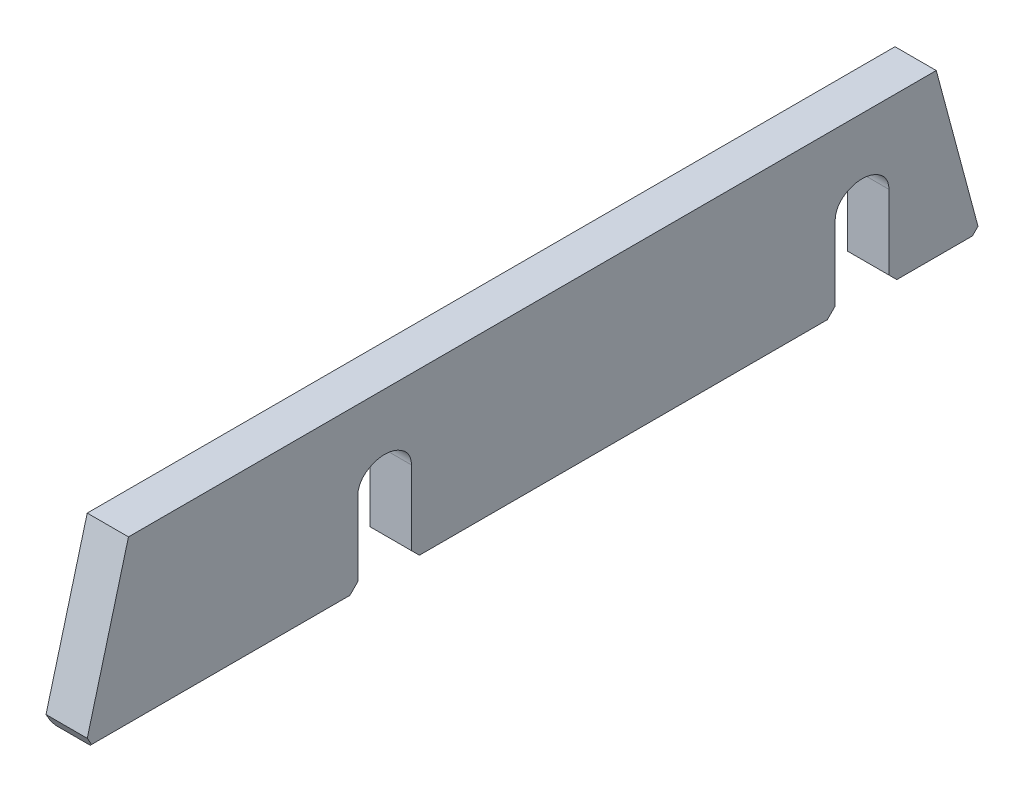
ISO-10303-21;
HEADER;
FILE_DESCRIPTION(('STEP AP214'),'2;1');
FILE_NAME('part.step','',(''),(''),'','','');
FILE_SCHEMA(('AUTOMOTIVE_DESIGN { 1 0 10303 214 1 1 1 1 }'));
ENDSEC;
DATA;
#1=APPLICATION_CONTEXT('core data for automotive mechanical design processes');
#2=APPLICATION_PROTOCOL_DEFINITION('international standard','automotive_design',2000,#1);
#3=PRODUCT_CONTEXT('',#1,'mechanical');
#4=PRODUCT('Part','Part','',(#3));
#5=PRODUCT_RELATED_PRODUCT_CATEGORY('part','',(#4));
#6=PRODUCT_DEFINITION_FORMATION('','',#4);
#7=PRODUCT_DEFINITION_CONTEXT('part definition',#1,'design');
#8=PRODUCT_DEFINITION('design','',#6,#7);
#9=PRODUCT_DEFINITION_SHAPE('','',#8);
#10=(LENGTH_UNIT() NAMED_UNIT(*) SI_UNIT(.MILLI.,.METRE.));
#11=(NAMED_UNIT(*) PLANE_ANGLE_UNIT() SI_UNIT($,.RADIAN.));
#12=(NAMED_UNIT(*) SI_UNIT($,.STERADIAN.) SOLID_ANGLE_UNIT());
#13=UNCERTAINTY_MEASURE_WITH_UNIT(LENGTH_MEASURE(1.E-05),#10,'distance_accuracy_value','');
#14=(GEOMETRIC_REPRESENTATION_CONTEXT(3) GLOBAL_UNCERTAINTY_ASSIGNED_CONTEXT((#13)) GLOBAL_UNIT_ASSIGNED_CONTEXT((#10,
#11,#12)) REPRESENTATION_CONTEXT('',''));
#15=CARTESIAN_POINT('',(0.,0.,0.));
#16=DIRECTION('',(0.,0.,1.));
#17=DIRECTION('',(1.,0.,0.));
#18=AXIS2_PLACEMENT_3D('',#15,#16,#17);
#19=CARTESIAN_POINT('',(101.6,-405.4975,1989.725));
#20=DIRECTION('',(0.,1.,0.));
#21=DIRECTION('',(0.,0.,1.));
#22=AXIS2_PLACEMENT_3D('',#19,#20,#21);
#23=PLANE('',#22);
#24=DIRECTION('',(0.,0.,-1.));
#25=VECTOR('',#24,1.);
#26=CARTESIAN_POINT('',(-85.6,-405.4975,1989.725));
#27=LINE('',#26,#25);
#28=CARTESIAN_POINT('',(-85.6,-405.4975,540.537499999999));
#29=VERTEX_POINT('',#28);
#30=CARTESIAN_POINT('',(-85.6,-405.4975,-1436.8985));
#31=VERTEX_POINT('',#30);
#32=EDGE_CURVE('E309',#29,#31,#27,.T.);
#33=ORIENTED_EDGE('',*,*,#32,.T.);
#34=DIRECTION('',(1.,0.,0.));
#35=VECTOR('',#34,1.);
#36=CARTESIAN_POINT('',(101.6,-405.4975,-1436.8985));
#37=LINE('',#36,#35);
#38=CARTESIAN_POINT('',(85.6,-405.4975,-1436.8985));
#39=VERTEX_POINT('',#38);
#40=EDGE_CURVE('E398',#31,#39,#37,.T.);
#41=ORIENTED_EDGE('',*,*,#40,.T.);
#42=DIRECTION('',(0.,0.,1.));
#43=VECTOR('',#42,1.);
#44=CARTESIAN_POINT('',(85.6,-405.4975,595.5375));
#45=LINE('',#44,#43);
#46=CARTESIAN_POINT('',(85.6,-405.4975,540.537499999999));
#47=VERTEX_POINT('',#46);
#48=EDGE_CURVE('E313',#39,#47,#45,.T.);
#49=ORIENTED_EDGE('',*,*,#48,.T.);
#50=DIRECTION('',(-1.,0.,0.));
#51=VECTOR('',#50,1.);
#52=CARTESIAN_POINT('',(101.6,-405.4975,540.537499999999));
#53=LINE('',#52,#51);
#54=EDGE_CURVE('E400',#47,#29,#53,.T.);
#55=ORIENTED_EDGE('',*,*,#54,.T.);
#56=EDGE_LOOP('',(#33,#41,#49,#55));
#57=FACE_BOUND('',#56,.T.);
#58=ADVANCED_FACE('F69',(#57),#23,.F.);
#59=DIRECTION('',(0.,0.,-1.));
#60=VECTOR('',#59,1.);
#61=CARTESIAN_POINT('',(-85.5999999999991,-405.4975,1989.725));
#62=LINE('',#61,#60);
#63=CARTESIAN_POINT('',(-85.5999999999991,-405.4975,-1811.4625));
#64=VERTEX_POINT('',#63);
#65=CARTESIAN_POINT('',(-85.5999999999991,-405.4975,-2152.03045531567));
#66=VERTEX_POINT('',#65);
#67=EDGE_CURVE('E305',#64,#66,#62,.T.);
#68=ORIENTED_EDGE('',*,*,#67,.T.);
#69=DIRECTION('',(1.,0.,0.));
#70=VECTOR('',#69,1.);
#71=CARTESIAN_POINT('',(101.6,-405.4975,-2152.03045531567));
#72=LINE('',#71,#70);
#73=CARTESIAN_POINT('',(85.5999999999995,-405.4975,-2152.03045531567));
#74=VERTEX_POINT('',#73);
#75=EDGE_CURVE('E366',#66,#74,#72,.T.);
#76=ORIENTED_EDGE('',*,*,#75,.T.);
#77=DIRECTION('',(0.,0.,1.));
#78=VECTOR('',#77,1.);
#79=CARTESIAN_POINT('',(85.5999999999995,-405.4975,-1756.4625));
#80=LINE('',#79,#78);
#81=CARTESIAN_POINT('',(85.5999999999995,-405.4975,-1811.4625));
#82=VERTEX_POINT('',#81);
#83=EDGE_CURVE('E306',#74,#82,#80,.T.);
#84=ORIENTED_EDGE('',*,*,#83,.T.);
#85=DIRECTION('',(-1.,0.,0.));
#86=VECTOR('',#85,1.);
#87=CARTESIAN_POINT('',(101.6,-405.4975,-1811.4625));
#88=LINE('',#87,#86);
#89=EDGE_CURVE('E361',#82,#64,#88,.T.);
#90=ORIENTED_EDGE('',*,*,#89,.T.);
#91=EDGE_LOOP('',(#68,#76,#84,#90));
#92=FACE_BOUND('',#91,.T.);
#93=ADVANCED_FACE('F598',(#92),#23,.F.);
#94=CARTESIAN_POINT('',(101.6,405.4975,1989.725));
#95=DIRECTION('',(0.,-1.,0.));
#96=DIRECTION('',(0.,0.,-1.));
#97=AXIS2_PLACEMENT_3D('',#94,#95,#96);
#98=PLANE('',#97);
#99=DIRECTION('',(0.,0.,1.));
#100=VECTOR('',#99,1.);
#101=CARTESIAN_POINT('',(-101.6,405.4975,1989.725));
#102=LINE('',#101,#100);
#103=CARTESIAN_POINT('',(-101.6,405.4975,-1989.725));
#104=VERTEX_POINT('',#103);
#105=CARTESIAN_POINT('',(-101.6,405.4975,1989.725));
#106=VERTEX_POINT('',#105);
#107=EDGE_CURVE('E260',#104,#106,#102,.T.);
#108=ORIENTED_EDGE('',*,*,#107,.T.);
#109=DIRECTION('',(-1.,0.,0.));
#110=VECTOR('',#109,1.);
#111=CARTESIAN_POINT('',(101.6,405.4975,1989.725));
#112=LINE('',#111,#110);
#113=CARTESIAN_POINT('',(101.6,405.4975,1989.725));
#114=VERTEX_POINT('',#113);
#115=EDGE_CURVE('E265',#114,#106,#112,.T.);
#116=ORIENTED_EDGE('',*,*,#115,.F.);
#117=DIRECTION('',(0.,0.,1.));
#118=VECTOR('',#117,1.);
#119=CARTESIAN_POINT('',(101.6,405.4975,1989.725));
#120=LINE('',#119,#118);
#121=CARTESIAN_POINT('',(101.6,405.4975,-1989.725));
#122=VERTEX_POINT('',#121);
#123=EDGE_CURVE('E266',#122,#114,#120,.T.);
#124=ORIENTED_EDGE('',*,*,#123,.F.);
#125=DIRECTION('',(-1.,0.,0.));
#126=VECTOR('',#125,1.);
#127=CARTESIAN_POINT('',(101.6,405.4975,-1989.725));
#128=LINE('',#127,#126);
#129=EDGE_CURVE('E263',#122,#104,#128,.T.);
#130=ORIENTED_EDGE('',*,*,#129,.T.);
#131=EDGE_LOOP('',(#108,#116,#124,#130));
#132=FACE_BOUND('',#131,.T.);
#133=ADVANCED_FACE('F258',(#132),#98,.F.);
#134=DIRECTION('',(0.,0.,-1.));
#135=VECTOR('',#134,1.);
#136=CARTESIAN_POINT('',(-85.6,-405.4975,1989.725));
#137=LINE('',#136,#135);
#138=CARTESIAN_POINT('',(-85.6,-405.4975,2162.12314336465));
#139=VERTEX_POINT('',#138);
#140=CARTESIAN_POINT('',(-85.6,-405.4975,915.101500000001));
#141=VERTEX_POINT('',#140);
#142=EDGE_CURVE('E319',#139,#141,#137,.T.);
#143=ORIENTED_EDGE('',*,*,#142,.T.);
#144=DIRECTION('',(1.,0.,0.));
#145=VECTOR('',#144,1.);
#146=CARTESIAN_POINT('',(101.6,-405.4975,915.101500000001));
#147=LINE('',#146,#145);
#148=CARTESIAN_POINT('',(85.5999999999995,-405.4975,915.101500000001));
#149=VERTEX_POINT('',#148);
#150=EDGE_CURVE('E428',#141,#149,#147,.T.);
#151=ORIENTED_EDGE('',*,*,#150,.T.);
#152=DIRECTION('',(0.,0.,1.));
#153=VECTOR('',#152,1.);
#154=CARTESIAN_POINT('',(85.5999999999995,-405.4975,2207.03045531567));
#155=LINE('',#154,#153);
#156=CARTESIAN_POINT('',(85.5999999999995,-405.4975,2162.12314336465));
#157=VERTEX_POINT('',#156);
#158=EDGE_CURVE('E321',#149,#157,#155,.T.);
#159=ORIENTED_EDGE('',*,*,#158,.T.);
#160=DIRECTION('',(-1.,0.,0.));
#161=VECTOR('',#160,1.);
#162=CARTESIAN_POINT('',(101.6,-405.4975,2162.12314336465));
#163=LINE('',#162,#161);
#164=EDGE_CURVE('E421',#157,#139,#163,.T.);
#165=ORIENTED_EDGE('',*,*,#164,.T.);
#166=EDGE_LOOP('',(#143,#151,#159,#165));
#167=FACE_BOUND('',#166,.T.);
#168=ADVANCED_FACE('F602',(#167),#23,.F.);
#169=CARTESIAN_POINT('',(101.6,0.,0.));
#170=DIRECTION('',(1.,0.,0.));
#171=DIRECTION('',(0.,0.,-1.));
#172=AXIS2_PLACEMENT_3D('',#169,#170,#171);
#173=PLANE('',#172);
#174=DIRECTION('',(0.,0.,-1.));
#175=VECTOR('',#174,1.);
#176=CARTESIAN_POINT('',(101.6,-389.497499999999,-2207.03045531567));
#177=LINE('',#176,#175);
#178=CARTESIAN_POINT('',(101.6,-389.497499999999,-1795.4625));
#179=VERTEX_POINT('',#178);
#180=CARTESIAN_POINT('',(101.6,-389.497499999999,-2168.03045531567));
#181=VERTEX_POINT('',#180);
#182=EDGE_CURVE('E296',#179,#181,#177,.T.);
#183=ORIENTED_EDGE('',*,*,#182,.T.);
#184=DIRECTION('',(0.,-0.707106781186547,0.707106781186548));
#185=VECTOR('',#184,1.);
#186=CARTESIAN_POINT('',(101.6,-1278.76397765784,-1278.76397765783));
#187=LINE('',#186,#185);
#188=CARTESIAN_POINT('',(101.6,-362.120367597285,-2195.40758771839));
#189=VERTEX_POINT('',#188);
#190=EDGE_CURVE('E389',#181,#189,#187,.F.);
#191=ORIENTED_EDGE('',*,*,#190,.T.);
#192=DIRECTION('',(0.,0.96592582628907,0.258819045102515));
#193=VECTOR('',#192,1.);
#194=CARTESIAN_POINT('',(101.6,405.4975,-1989.725));
#195=LINE('',#194,#193);
#196=EDGE_CURVE('E459',#189,#122,#195,.T.);
#197=ORIENTED_EDGE('',*,*,#196,.T.);
#198=ORIENTED_EDGE('',*,*,#123,.T.);
#199=DIRECTION('',(0.,-0.96592582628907,0.258819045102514));
#200=VECTOR('',#199,1.);
#201=CARTESIAN_POINT('',(101.6,405.4975,1989.725));
#202=LINE('',#201,#200);
#203=CARTESIAN_POINT('',(101.6,-352.371579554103,2192.79540783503));
#204=VERTEX_POINT('',#203);
#205=EDGE_CURVE('E279',#114,#204,#202,.T.);
#206=ORIENTED_EDGE('',*,*,#205,.T.);
#207=DIRECTION('',(0.,0.866025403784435,0.500000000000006));
#208=VECTOR('',#207,1.);
#209=CARTESIAN_POINT('',(101.6,-1037.60115913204,1797.17792560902));
#210=LINE('',#209,#208);
#211=CARTESIAN_POINT('',(101.6,-389.4975,2171.36074767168));
#212=VERTEX_POINT('',#211);
#213=EDGE_CURVE('E374',#204,#212,#210,.F.);
#214=ORIENTED_EDGE('',*,*,#213,.T.);
#215=DIRECTION('',(0.,0.,-1.));
#216=VECTOR('',#215,1.);
#217=CARTESIAN_POINT('',(101.6,-389.4975,860.1015));
#218=LINE('',#217,#216);
#219=CARTESIAN_POINT('',(101.6,-389.4975,899.101500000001));
#220=VERTEX_POINT('',#219);
#221=EDGE_CURVE('E287',#212,#220,#218,.T.);
#222=ORIENTED_EDGE('',*,*,#221,.T.);
#223=DIRECTION('',(0.,-0.707106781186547,0.707106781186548));
#224=VECTOR('',#223,1.);
#225=CARTESIAN_POINT('',(101.6,254.802,254.802));
#226=LINE('',#225,#224);
#227=CARTESIAN_POINT('',(101.6,-350.497499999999,860.1015));
#228=VERTEX_POINT('',#227);
#229=EDGE_CURVE('E377',#220,#228,#226,.F.);
#230=ORIENTED_EDGE('',*,*,#229,.T.);
#231=DIRECTION('',(0.,-1.,0.));
#232=VECTOR('',#231,1.);
#233=CARTESIAN_POINT('',(101.6,-405.4975,860.1015));
#234=LINE('',#233,#232);
#235=CARTESIAN_POINT('',(101.6,15.3246580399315,860.1015));
#236=VERTEX_POINT('',#235);
#237=EDGE_CURVE('E480',#236,#228,#234,.T.);
#238=ORIENTED_EDGE('',*,*,#237,.F.);
#239=CARTESIAN_POINT('',(101.6,15.3246580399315,760.1015));
#240=DIRECTION('',(1.,0.,0.));
#241=DIRECTION('',(0.,0.,1.));
#242=AXIS2_PLACEMENT_3D('',#239,#240,#241);
#243=CIRCLE('',#242,100.);
#244=CARTESIAN_POINT('',(101.6,93.8402975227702,822.03125340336));
#245=VERTEX_POINT('',#244);
#246=EDGE_CURVE('E472',#245,#236,#243,.T.);
#247=ORIENTED_EDGE('',*,*,#246,.F.);
#248=CARTESIAN_POINT('',(101.6,-25.6030339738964,727.8195));
#249=DIRECTION('',(1.,0.,0.));
#250=DIRECTION('',(0.,0.,1.));
#251=AXIS2_PLACEMENT_3D('',#248,#249,#250);
#252=CIRCLE('',#251,152.126802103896);
#253=CARTESIAN_POINT('',(101.6,93.84029752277,633.607746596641));
#254=VERTEX_POINT('',#253);
#255=EDGE_CURVE('E469',#254,#245,#252,.T.);
#256=ORIENTED_EDGE('',*,*,#255,.F.);
#257=CARTESIAN_POINT('',(101.6,15.3246580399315,695.5375));
#258=DIRECTION('',(1.,0.,0.));
#259=DIRECTION('',(0.,0.,-1.));
#260=AXIS2_PLACEMENT_3D('',#257,#258,#259);
#261=CIRCLE('',#260,100.);
#262=CARTESIAN_POINT('',(101.6,15.3246580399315,595.5375));
#263=VERTEX_POINT('',#262);
#264=EDGE_CURVE('E461',#263,#254,#261,.T.);
#265=ORIENTED_EDGE('',*,*,#264,.F.);
#266=DIRECTION('',(0.,1.,0.));
#267=VECTOR('',#266,1.);
#268=CARTESIAN_POINT('',(101.6,-405.4975,595.5375));
#269=LINE('',#268,#267);
#270=CARTESIAN_POINT('',(101.6,-350.497499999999,595.5375));
#271=VERTEX_POINT('',#270);
#272=EDGE_CURVE('E462',#271,#263,#269,.T.);
#273=ORIENTED_EDGE('',*,*,#272,.F.);
#274=DIRECTION('',(0.,0.707106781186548,0.707106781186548));
#275=VECTOR('',#274,1.);
#276=CARTESIAN_POINT('',(101.6,-473.0175,473.0175));
#277=LINE('',#276,#275);
#278=CARTESIAN_POINT('',(101.6,-389.4975,556.537499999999));
#279=VERTEX_POINT('',#278);
#280=EDGE_CURVE('E382',#271,#279,#277,.F.);
#281=ORIENTED_EDGE('',*,*,#280,.T.);
#282=DIRECTION('',(0.,0.,-1.));
#283=VECTOR('',#282,1.);
#284=CARTESIAN_POINT('',(101.6,-389.4975,-1491.8985));
#285=LINE('',#284,#283);
#286=CARTESIAN_POINT('',(101.6,-389.4975,-1452.8985));
#287=VERTEX_POINT('',#286);
#288=EDGE_CURVE('E293',#279,#287,#285,.T.);
#289=ORIENTED_EDGE('',*,*,#288,.T.);
#290=DIRECTION('',(0.,-0.707106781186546,0.707106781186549));
#291=VECTOR('',#290,1.);
#292=CARTESIAN_POINT('',(101.6,-921.198,-921.197999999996));
#293=LINE('',#292,#291);
#294=CARTESIAN_POINT('',(101.6,-350.497499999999,-1491.8985));
#295=VERTEX_POINT('',#294);
#296=EDGE_CURVE('E381',#287,#295,#293,.F.);
#297=ORIENTED_EDGE('',*,*,#296,.T.);
#298=DIRECTION('',(0.,-1.,0.));
#299=VECTOR('',#298,1.);
#300=CARTESIAN_POINT('',(101.6,15.3246580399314,-1491.8985));
#301=LINE('',#300,#299);
#302=CARTESIAN_POINT('',(101.6,15.3246580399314,-1491.8985));
#303=VERTEX_POINT('',#302);
#304=EDGE_CURVE('E538',#303,#295,#301,.T.);
#305=ORIENTED_EDGE('',*,*,#304,.F.);
#306=CARTESIAN_POINT('',(101.6,15.3246580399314,-1591.8985));
#307=DIRECTION('',(1.,0.,0.));
#308=DIRECTION('',(0.,0.,-1.));
#309=AXIS2_PLACEMENT_3D('',#306,#307,#308);
#310=CIRCLE('',#309,100.);
#311=CARTESIAN_POINT('',(101.6,93.8402975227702,-1529.96874659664));
#312=VERTEX_POINT('',#311);
#313=EDGE_CURVE('E544',#312,#303,#310,.T.);
#314=ORIENTED_EDGE('',*,*,#313,.F.);
#315=CARTESIAN_POINT('',(101.6,-25.6030339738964,-1624.1805));
#316=DIRECTION('',(1.,0.,0.));
#317=DIRECTION('',(0.,0.,1.));
#318=AXIS2_PLACEMENT_3D('',#315,#316,#317);
#319=CIRCLE('',#318,152.126802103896);
#320=CARTESIAN_POINT('',(101.6,93.8402975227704,-1718.39225340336));
#321=VERTEX_POINT('',#320);
#322=EDGE_CURVE('E550',#321,#312,#319,.T.);
#323=ORIENTED_EDGE('',*,*,#322,.F.);
#324=CARTESIAN_POINT('',(101.6,15.3246580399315,-1656.4625));
#325=DIRECTION('',(1.,0.,0.));
#326=DIRECTION('',(0.,0.,1.));
#327=AXIS2_PLACEMENT_3D('',#324,#325,#326);
#328=CIRCLE('',#327,100.);
#329=CARTESIAN_POINT('',(101.6,15.3246580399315,-1756.4625));
#330=VERTEX_POINT('',#329);
#331=EDGE_CURVE('E553',#330,#321,#328,.T.);
#332=ORIENTED_EDGE('',*,*,#331,.F.);
#333=DIRECTION('',(0.,1.,0.));
#334=VECTOR('',#333,1.);
#335=CARTESIAN_POINT('',(101.6,-405.4975,-1756.4625));
#336=LINE('',#335,#334);
#337=CARTESIAN_POINT('',(101.6,-350.497499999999,-1756.4625));
#338=VERTEX_POINT('',#337);
#339=EDGE_CURVE('E463',#338,#330,#336,.T.);
#340=ORIENTED_EDGE('',*,*,#339,.F.);
#341=DIRECTION('',(0.,0.707106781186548,0.707106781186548));
#342=VECTOR('',#341,1.);
#343=CARTESIAN_POINT('',(101.6,702.982500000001,-702.982500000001));
#344=LINE('',#343,#342);
#345=EDGE_CURVE('E390',#338,#179,#344,.F.);
#346=ORIENTED_EDGE('',*,*,#345,.T.);
#347=EDGE_LOOP('',(#183,#191,#197,#198,#206,#214,#222,#230,#238,#247,#256,#265,#273,#281,#289,
#297,#305,#314,#323,#332,#340,#346));
#348=FACE_BOUND('',#347,.T.);
#349=ADVANCED_FACE('F450',(#348),#173,.T.);
#350=CARTESIAN_POINT('',(-101.6,0.,0.));
#351=DIRECTION('',(1.,0.,0.));
#352=DIRECTION('',(0.,0.,-1.));
#353=AXIS2_PLACEMENT_3D('',#350,#351,#352);
#354=PLANE('',#353);
#355=DIRECTION('',(0.,0.96592582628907,0.258819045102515));
#356=VECTOR('',#355,1.);
#357=CARTESIAN_POINT('',(-101.6,405.4975,-1989.725));
#358=LINE('',#357,#356);
#359=CARTESIAN_POINT('',(-101.6,-362.120367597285,-2195.40758771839));
#360=VERTEX_POINT('',#359);
#361=EDGE_CURVE('E282',#360,#104,#358,.T.);
#362=ORIENTED_EDGE('',*,*,#361,.F.);
#363=DIRECTION('',(0.,0.707106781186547,-0.707106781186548));
#364=VECTOR('',#363,1.);
#365=CARTESIAN_POINT('',(-101.6,-362.120367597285,-2195.40758771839));
#366=LINE('',#365,#364);
#367=CARTESIAN_POINT('',(-101.6,-389.497499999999,-2168.03045531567));
#368=VERTEX_POINT('',#367);
#369=EDGE_CURVE('E351',#360,#368,#366,.F.);
#370=ORIENTED_EDGE('',*,*,#369,.T.);
#371=DIRECTION('',(0.,0.,1.));
#372=VECTOR('',#371,1.);
#373=CARTESIAN_POINT('',(-101.6,-389.4975,0.));
#374=LINE('',#373,#372);
#375=CARTESIAN_POINT('',(-101.6,-389.497499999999,-1795.4625));
#376=VERTEX_POINT('',#375);
#377=EDGE_CURVE('E335',#368,#376,#374,.T.);
#378=ORIENTED_EDGE('',*,*,#377,.T.);
#379=DIRECTION('',(0.,-0.707106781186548,-0.707106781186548));
#380=VECTOR('',#379,1.);
#381=CARTESIAN_POINT('',(-101.6,-350.497499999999,-1756.4625));
#382=LINE('',#381,#380);
#383=CARTESIAN_POINT('',(-101.6,-350.497499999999,-1756.4625));
#384=VERTEX_POINT('',#383);
#385=EDGE_CURVE('E352',#376,#384,#382,.F.);
#386=ORIENTED_EDGE('',*,*,#385,.T.);
#387=DIRECTION('',(0.,1.,0.));
#388=VECTOR('',#387,1.);
#389=CARTESIAN_POINT('',(-101.6,-405.4975,-1756.4625));
#390=LINE('',#389,#388);
#391=CARTESIAN_POINT('',(-101.6,15.3246580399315,-1756.4625));
#392=VERTEX_POINT('',#391);
#393=EDGE_CURVE('E536',#384,#392,#390,.T.);
#394=ORIENTED_EDGE('',*,*,#393,.T.);
#395=CARTESIAN_POINT('',(-101.6,15.3246580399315,-1656.4625));
#396=DIRECTION('',(1.,0.,0.));
#397=DIRECTION('',(0.,0.,1.));
#398=AXIS2_PLACEMENT_3D('',#395,#396,#397);
#399=CIRCLE('',#398,100.);
#400=CARTESIAN_POINT('',(-101.6,93.8402975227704,-1718.39225340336));
#401=VERTEX_POINT('',#400);
#402=EDGE_CURVE('E535',#392,#401,#399,.T.);
#403=ORIENTED_EDGE('',*,*,#402,.T.);
#404=CARTESIAN_POINT('',(-101.6,-25.6030339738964,-1624.1805));
#405=DIRECTION('',(1.,0.,0.));
#406=DIRECTION('',(0.,0.,1.));
#407=AXIS2_PLACEMENT_3D('',#404,#405,#406);
#408=CIRCLE('',#407,152.126802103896);
#409=CARTESIAN_POINT('',(-101.6,93.8402975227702,-1529.96874659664));
#410=VERTEX_POINT('',#409);
#411=EDGE_CURVE('E529',#401,#410,#408,.T.);
#412=ORIENTED_EDGE('',*,*,#411,.T.);
#413=CARTESIAN_POINT('',(-101.6,15.3246580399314,-1591.8985));
#414=DIRECTION('',(1.,0.,0.));
#415=DIRECTION('',(0.,0.,-1.));
#416=AXIS2_PLACEMENT_3D('',#413,#414,#415);
#417=CIRCLE('',#416,100.);
#418=CARTESIAN_POINT('',(-101.6,15.3246580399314,-1491.8985));
#419=VERTEX_POINT('',#418);
#420=EDGE_CURVE('E521',#410,#419,#417,.T.);
#421=ORIENTED_EDGE('',*,*,#420,.T.);
#422=DIRECTION('',(0.,-1.,0.));
#423=VECTOR('',#422,1.);
#424=CARTESIAN_POINT('',(-101.6,15.3246580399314,-1491.8985));
#425=LINE('',#424,#423);
#426=CARTESIAN_POINT('',(-101.6,-350.497499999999,-1491.8985));
#427=VERTEX_POINT('',#426);
#428=EDGE_CURVE('E513',#419,#427,#425,.T.);
#429=ORIENTED_EDGE('',*,*,#428,.T.);
#430=DIRECTION('',(0.,0.707106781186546,-0.707106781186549));
#431=VECTOR('',#430,1.);
#432=CARTESIAN_POINT('',(-101.6,-405.4975,-1436.8985));
#433=LINE('',#432,#431);
#434=CARTESIAN_POINT('',(-101.6,-389.4975,-1452.8985));
#435=VERTEX_POINT('',#434);
#436=EDGE_CURVE('E349',#427,#435,#433,.F.);
#437=ORIENTED_EDGE('',*,*,#436,.T.);
#438=DIRECTION('',(0.,0.,1.));
#439=VECTOR('',#438,1.);
#440=CARTESIAN_POINT('',(-101.6,-389.4975,0.));
#441=LINE('',#440,#439);
#442=CARTESIAN_POINT('',(-101.6,-389.4975,556.537499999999));
#443=VERTEX_POINT('',#442);
#444=EDGE_CURVE('E329',#435,#443,#441,.T.);
#445=ORIENTED_EDGE('',*,*,#444,.T.);
#446=DIRECTION('',(0.,-0.707106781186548,-0.707106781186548));
#447=VECTOR('',#446,1.);
#448=CARTESIAN_POINT('',(-101.6,-350.497499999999,595.5375));
#449=LINE('',#448,#447);
#450=CARTESIAN_POINT('',(-101.6,-350.497499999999,595.5375));
#451=VERTEX_POINT('',#450);
#452=EDGE_CURVE('E344',#443,#451,#449,.F.);
#453=ORIENTED_EDGE('',*,*,#452,.T.);
#454=DIRECTION('',(0.,1.,0.));
#455=VECTOR('',#454,1.);
#456=CARTESIAN_POINT('',(-101.6,-405.4975,595.5375));
#457=LINE('',#456,#455);
#458=CARTESIAN_POINT('',(-101.6,15.3246580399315,595.5375));
#459=VERTEX_POINT('',#458);
#460=EDGE_CURVE('E482',#451,#459,#457,.T.);
#461=ORIENTED_EDGE('',*,*,#460,.T.);
#462=CARTESIAN_POINT('',(-101.6,15.3246580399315,695.5375));
#463=DIRECTION('',(1.,0.,0.));
#464=DIRECTION('',(0.,0.,-1.));
#465=AXIS2_PLACEMENT_3D('',#462,#463,#464);
#466=CIRCLE('',#465,100.);
#467=CARTESIAN_POINT('',(-101.6,93.84029752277,633.607746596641));
#468=VERTEX_POINT('',#467);
#469=EDGE_CURVE('E481',#459,#468,#466,.T.);
#470=ORIENTED_EDGE('',*,*,#469,.T.);
#471=CARTESIAN_POINT('',(-101.6,-25.6030339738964,727.8195));
#472=DIRECTION('',(1.,0.,0.));
#473=DIRECTION('',(0.,0.,1.));
#474=AXIS2_PLACEMENT_3D('',#471,#472,#473);
#475=CIRCLE('',#474,152.126802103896);
#476=CARTESIAN_POINT('',(-101.6,93.8402975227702,822.03125340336));
#477=VERTEX_POINT('',#476);
#478=EDGE_CURVE('E486',#468,#477,#475,.T.);
#479=ORIENTED_EDGE('',*,*,#478,.T.);
#480=CARTESIAN_POINT('',(-101.6,15.3246580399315,760.1015));
#481=DIRECTION('',(1.,0.,0.));
#482=DIRECTION('',(0.,0.,1.));
#483=AXIS2_PLACEMENT_3D('',#480,#481,#482);
#484=CIRCLE('',#483,100.);
#485=CARTESIAN_POINT('',(-101.6,15.3246580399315,860.1015));
#486=VERTEX_POINT('',#485);
#487=EDGE_CURVE('E495',#477,#486,#484,.T.);
#488=ORIENTED_EDGE('',*,*,#487,.T.);
#489=DIRECTION('',(0.,-1.,0.));
#490=VECTOR('',#489,1.);
#491=CARTESIAN_POINT('',(-101.6,-405.4975,860.1015));
#492=LINE('',#491,#490);
#493=CARTESIAN_POINT('',(-101.6,-350.497499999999,860.1015));
#494=VERTEX_POINT('',#493);
#495=EDGE_CURVE('E496',#486,#494,#492,.T.);
#496=ORIENTED_EDGE('',*,*,#495,.T.);
#497=DIRECTION('',(0.,0.707106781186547,-0.707106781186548));
#498=VECTOR('',#497,1.);
#499=CARTESIAN_POINT('',(-101.6,-405.4975,915.101500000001));
#500=LINE('',#499,#498);
#501=CARTESIAN_POINT('',(-101.6,-389.4975,899.101500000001));
#502=VERTEX_POINT('',#501);
#503=EDGE_CURVE('E345',#494,#502,#500,.F.);
#504=ORIENTED_EDGE('',*,*,#503,.T.);
#505=DIRECTION('',(0.,0.,1.));
#506=VECTOR('',#505,1.);
#507=CARTESIAN_POINT('',(-101.6,-389.4975,0.));
#508=LINE('',#507,#506);
#509=CARTESIAN_POINT('',(-101.6,-389.4975,2171.36074767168));
#510=VERTEX_POINT('',#509);
#511=EDGE_CURVE('E324',#502,#510,#508,.T.);
#512=ORIENTED_EDGE('',*,*,#511,.T.);
#513=DIRECTION('',(0.,-0.866025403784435,-0.500000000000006));
#514=VECTOR('',#513,1.);
#515=CARTESIAN_POINT('',(-101.6,-405.4975,2162.12314336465));
#516=LINE('',#515,#514);
#517=CARTESIAN_POINT('',(-101.6,-352.371579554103,2192.79540783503));
#518=VERTEX_POINT('',#517);
#519=EDGE_CURVE('E276',#510,#518,#516,.F.);
#520=ORIENTED_EDGE('',*,*,#519,.T.);
#521=DIRECTION('',(0.,-0.96592582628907,0.258819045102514));
#522=VECTOR('',#521,1.);
#523=CARTESIAN_POINT('',(-101.6,405.4975,1989.725));
#524=LINE('',#523,#522);
#525=EDGE_CURVE('E271',#106,#518,#524,.T.);
#526=ORIENTED_EDGE('',*,*,#525,.F.);
#527=ORIENTED_EDGE('',*,*,#107,.F.);
#528=EDGE_LOOP('',(#362,#370,#378,#386,#394,#403,#412,#421,#429,#437,#445,#453,#461,#470,#479,
#488,#496,#504,#512,#520,#526,#527));
#529=FACE_BOUND('',#528,.T.);
#530=ADVANCED_FACE('F274',(#529),#354,.F.);
#531=CARTESIAN_POINT('',(-101.6,15.3246580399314,-1491.8985));
#532=DIRECTION('',(0.,0.,1.));
#533=DIRECTION('',(1.,0.,0.));
#534=AXIS2_PLACEMENT_3D('',#531,#532,#533);
#535=PLANE('',#534);
#536=ORIENTED_EDGE('',*,*,#304,.T.);
#537=DIRECTION('',(-1.,0.,0.));
#538=VECTOR('',#537,1.);
#539=CARTESIAN_POINT('',(-101.6,-350.497499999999,-1491.8985));
#540=LINE('',#539,#538);
#541=EDGE_CURVE('E409',#295,#427,#540,.T.);
#542=ORIENTED_EDGE('',*,*,#541,.T.);
#543=ORIENTED_EDGE('',*,*,#428,.F.);
#544=DIRECTION('',(1.,0.,0.));
#545=VECTOR('',#544,1.);
#546=CARTESIAN_POINT('',(-101.6,15.3246580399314,-1491.8985));
#547=LINE('',#546,#545);
#548=EDGE_CURVE('E448',#419,#303,#547,.T.);
#549=ORIENTED_EDGE('',*,*,#548,.T.);
#550=EDGE_LOOP('',(#536,#542,#543,#549));
#551=FACE_BOUND('',#550,.T.);
#552=ADVANCED_FACE('F668',(#551),#535,.F.);
#553=CARTESIAN_POINT('',(-101.6,15.3246580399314,-1591.8985));
#554=DIRECTION('',(1.,0.,0.));
#555=DIRECTION('',(0.,0.,-1.));
#556=AXIS2_PLACEMENT_3D('',#553,#554,#555);
#557=CYLINDRICAL_SURFACE('',#556,100.);
#558=ORIENTED_EDGE('',*,*,#548,.F.);
#559=ORIENTED_EDGE('',*,*,#420,.F.);
#560=DIRECTION('',(1.,0.,0.));
#561=VECTOR('',#560,1.);
#562=CARTESIAN_POINT('',(-101.6,93.8402975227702,-1529.96874659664));
#563=LINE('',#562,#561);
#564=EDGE_CURVE('E452',#410,#312,#563,.T.);
#565=ORIENTED_EDGE('',*,*,#564,.T.);
#566=ORIENTED_EDGE('',*,*,#313,.T.);
#567=EDGE_LOOP('',(#558,#559,#565,#566));
#568=FACE_BOUND('',#567,.T.);
#569=ADVANCED_FACE('F675',(#568),#557,.F.);
#570=CARTESIAN_POINT('',(-101.6,-25.6030339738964,-1624.1805));
#571=DIRECTION('',(1.,0.,0.));
#572=DIRECTION('',(0.,0.,-1.));
#573=AXIS2_PLACEMENT_3D('',#570,#571,#572);
#574=CYLINDRICAL_SURFACE('',#573,152.126802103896);
#575=ORIENTED_EDGE('',*,*,#564,.F.);
#576=ORIENTED_EDGE('',*,*,#411,.F.);
#577=DIRECTION('',(1.,0.,0.));
#578=VECTOR('',#577,1.);
#579=CARTESIAN_POINT('',(-101.6,93.8402975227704,-1718.39225340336));
#580=LINE('',#579,#578);
#581=EDGE_CURVE('E516',#401,#321,#580,.T.);
#582=ORIENTED_EDGE('',*,*,#581,.T.);
#583=ORIENTED_EDGE('',*,*,#322,.T.);
#584=EDGE_LOOP('',(#575,#576,#582,#583));
#585=FACE_BOUND('',#584,.T.);
#586=ADVANCED_FACE('F575',(#585),#574,.F.);
#587=CARTESIAN_POINT('',(-101.6,15.3246580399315,-1656.4625));
#588=DIRECTION('',(1.,0.,0.));
#589=DIRECTION('',(0.,0.,-1.));
#590=AXIS2_PLACEMENT_3D('',#587,#588,#589);
#591=CYLINDRICAL_SURFACE('',#590,100.);
#592=ORIENTED_EDGE('',*,*,#581,.F.);
#593=ORIENTED_EDGE('',*,*,#402,.F.);
#594=DIRECTION('',(1.,0.,0.));
#595=VECTOR('',#594,1.);
#596=CARTESIAN_POINT('',(-101.6,15.3246580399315,-1756.4625));
#597=LINE('',#596,#595);
#598=EDGE_CURVE('E512',#392,#330,#597,.T.);
#599=ORIENTED_EDGE('',*,*,#598,.T.);
#600=ORIENTED_EDGE('',*,*,#331,.T.);
#601=EDGE_LOOP('',(#592,#593,#599,#600));
#602=FACE_BOUND('',#601,.T.);
#603=ADVANCED_FACE('F570',(#602),#591,.F.);
#604=CARTESIAN_POINT('',(-101.6,-405.4975,-1756.4625));
#605=DIRECTION('',(0.,0.,-1.));
#606=DIRECTION('',(-1.,0.,0.));
#607=AXIS2_PLACEMENT_3D('',#604,#605,#606);
#608=PLANE('',#607);
#609=ORIENTED_EDGE('',*,*,#393,.F.);
#610=DIRECTION('',(1.,0.,0.));
#611=VECTOR('',#610,1.);
#612=CARTESIAN_POINT('',(-101.6,-350.497499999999,-1756.4625));
#613=LINE('',#612,#611);
#614=EDGE_CURVE('E394',#384,#338,#613,.T.);
#615=ORIENTED_EDGE('',*,*,#614,.T.);
#616=ORIENTED_EDGE('',*,*,#339,.T.);
#617=ORIENTED_EDGE('',*,*,#598,.F.);
#618=EDGE_LOOP('',(#609,#615,#616,#617));
#619=FACE_BOUND('',#618,.T.);
#620=ADVANCED_FACE('F565',(#619),#608,.F.);
#621=CARTESIAN_POINT('',(-101.6,-405.4975,860.1015));
#622=DIRECTION('',(0.,0.,1.));
#623=DIRECTION('',(0.,-1.,0.));
#624=AXIS2_PLACEMENT_3D('',#621,#622,#623);
#625=PLANE('',#624);
#626=ORIENTED_EDGE('',*,*,#237,.T.);
#627=DIRECTION('',(-1.,0.,0.));
#628=VECTOR('',#627,1.);
#629=CARTESIAN_POINT('',(-101.6,-350.497499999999,860.1015));
#630=LINE('',#629,#628);
#631=EDGE_CURVE('E436',#228,#494,#630,.T.);
#632=ORIENTED_EDGE('',*,*,#631,.T.);
#633=ORIENTED_EDGE('',*,*,#495,.F.);
#634=DIRECTION('',(1.,0.,0.));
#635=VECTOR('',#634,1.);
#636=CARTESIAN_POINT('',(-101.6,15.3246580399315,860.1015));
#637=LINE('',#636,#635);
#638=EDGE_CURVE('E268',#486,#236,#637,.T.);
#639=ORIENTED_EDGE('',*,*,#638,.T.);
#640=EDGE_LOOP('',(#626,#632,#633,#639));
#641=FACE_BOUND('',#640,.T.);
#642=ADVANCED_FACE('F628',(#641),#625,.F.);
#643=CARTESIAN_POINT('',(-101.6,15.3246580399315,760.1015));
#644=DIRECTION('',(1.,0.,0.));
#645=DIRECTION('',(0.,0.,-1.));
#646=AXIS2_PLACEMENT_3D('',#643,#644,#645);
#647=CYLINDRICAL_SURFACE('',#646,100.);
#648=ORIENTED_EDGE('',*,*,#638,.F.);
#649=ORIENTED_EDGE('',*,*,#487,.F.);
#650=DIRECTION('',(1.,0.,0.));
#651=VECTOR('',#650,1.);
#652=CARTESIAN_POINT('',(-101.6,93.8402975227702,822.03125340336));
#653=LINE('',#652,#651);
#654=EDGE_CURVE('E505',#477,#245,#653,.T.);
#655=ORIENTED_EDGE('',*,*,#654,.T.);
#656=ORIENTED_EDGE('',*,*,#246,.T.);
#657=EDGE_LOOP('',(#648,#649,#655,#656));
#658=FACE_BOUND('',#657,.T.);
#659=ADVANCED_FACE('F635',(#658),#647,.F.);
#660=CARTESIAN_POINT('',(-101.6,-25.6030339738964,727.8195));
#661=DIRECTION('',(1.,0.,0.));
#662=DIRECTION('',(0.,0.,-1.));
#663=AXIS2_PLACEMENT_3D('',#660,#661,#662);
#664=CYLINDRICAL_SURFACE('',#663,152.126802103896);
#665=ORIENTED_EDGE('',*,*,#654,.F.);
#666=ORIENTED_EDGE('',*,*,#478,.F.);
#667=DIRECTION('',(1.,0.,0.));
#668=VECTOR('',#667,1.);
#669=CARTESIAN_POINT('',(-101.6,93.84029752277,633.607746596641));
#670=LINE('',#669,#668);
#671=EDGE_CURVE('E504',#468,#254,#670,.T.);
#672=ORIENTED_EDGE('',*,*,#671,.T.);
#673=ORIENTED_EDGE('',*,*,#255,.T.);
#674=EDGE_LOOP('',(#665,#666,#672,#673));
#675=FACE_BOUND('',#674,.T.);
#676=ADVANCED_FACE('F640',(#675),#664,.F.);
#677=CARTESIAN_POINT('',(-101.6,15.3246580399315,695.5375));
#678=DIRECTION('',(1.,0.,0.));
#679=DIRECTION('',(0.,0.,-1.));
#680=AXIS2_PLACEMENT_3D('',#677,#678,#679);
#681=CYLINDRICAL_SURFACE('',#680,100.);
#682=ORIENTED_EDGE('',*,*,#671,.F.);
#683=ORIENTED_EDGE('',*,*,#469,.F.);
#684=DIRECTION('',(1.,0.,0.));
#685=VECTOR('',#684,1.);
#686=CARTESIAN_POINT('',(-101.6,15.3246580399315,595.5375));
#687=LINE('',#686,#685);
#688=EDGE_CURVE('E497',#459,#263,#687,.T.);
#689=ORIENTED_EDGE('',*,*,#688,.T.);
#690=ORIENTED_EDGE('',*,*,#264,.T.);
#691=EDGE_LOOP('',(#682,#683,#689,#690));
#692=FACE_BOUND('',#691,.T.);
#693=ADVANCED_FACE('F642',(#692),#681,.F.);
#694=CARTESIAN_POINT('',(-101.6,-405.4975,595.5375));
#695=DIRECTION('',(0.,0.,-1.));
#696=DIRECTION('',(-1.,0.,0.));
#697=AXIS2_PLACEMENT_3D('',#694,#695,#696);
#698=PLANE('',#697);
#699=ORIENTED_EDGE('',*,*,#460,.F.);
#700=DIRECTION('',(1.,0.,0.));
#701=VECTOR('',#700,1.);
#702=CARTESIAN_POINT('',(-101.6,-350.497499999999,595.5375));
#703=LINE('',#702,#701);
#704=EDGE_CURVE('E416',#451,#271,#703,.T.);
#705=ORIENTED_EDGE('',*,*,#704,.T.);
#706=ORIENTED_EDGE('',*,*,#272,.T.);
#707=ORIENTED_EDGE('',*,*,#688,.F.);
#708=EDGE_LOOP('',(#699,#705,#706,#707));
#709=FACE_BOUND('',#708,.T.);
#710=ADVANCED_FACE('F643',(#709),#698,.F.);
#711=CARTESIAN_POINT('',(101.6,405.4975,-1989.725));
#712=DIRECTION('',(0.,-0.258819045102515,0.96592582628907));
#713=DIRECTION('',(0.,-0.96592582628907,-0.258819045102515));
#714=AXIS2_PLACEMENT_3D('',#711,#712,#713);
#715=PLANE('',#714);
#716=ORIENTED_EDGE('',*,*,#196,.F.);
#717=DIRECTION('',(-1.,0.,0.));
#718=VECTOR('',#717,1.);
#719=CARTESIAN_POINT('',(101.6,-362.120367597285,-2195.40758771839));
#720=LINE('',#719,#718);
#721=EDGE_CURVE('E337',#189,#360,#720,.T.);
#722=ORIENTED_EDGE('',*,*,#721,.T.);
#723=ORIENTED_EDGE('',*,*,#361,.T.);
#724=ORIENTED_EDGE('',*,*,#129,.F.);
#725=EDGE_LOOP('',(#716,#722,#723,#724));
#726=FACE_BOUND('',#725,.T.);
#727=ADVANCED_FACE('F591',(#726),#715,.F.);
#728=CARTESIAN_POINT('',(101.6,405.4975,1989.725));
#729=DIRECTION('',(0.,-0.258819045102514,-0.96592582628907));
#730=DIRECTION('',(0.,0.96592582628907,-0.258819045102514));
#731=AXIS2_PLACEMENT_3D('',#728,#729,#730);
#732=PLANE('',#731);
#733=ORIENTED_EDGE('',*,*,#525,.T.);
#734=DIRECTION('',(1.,0.,0.));
#735=VECTOR('',#734,1.);
#736=CARTESIAN_POINT('',(101.6,-352.371579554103,2192.79540783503));
#737=LINE('',#736,#735);
#738=EDGE_CURVE('E12',#518,#204,#737,.T.);
#739=ORIENTED_EDGE('',*,*,#738,.T.);
#740=ORIENTED_EDGE('',*,*,#205,.F.);
#741=ORIENTED_EDGE('',*,*,#115,.T.);
#742=EDGE_LOOP('',(#733,#739,#740,#741));
#743=FACE_BOUND('',#742,.T.);
#744=ADVANCED_FACE('F284',(#743),#732,.F.);
#745=CARTESIAN_POINT('',(101.6,-389.4975,0.));
#746=DIRECTION('',(0.707106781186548,-0.707106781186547,0.));
#747=DIRECTION('',(0.,0.,1.));
#748=AXIS2_PLACEMENT_3D('',#745,#746,#747);
#749=PLANE('',#748);
#750=ORIENTED_EDGE('',*,*,#83,.F.);
#751=DIRECTION('',(-0.577350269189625,-0.577350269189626,0.577350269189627));
#752=VECTOR('',#751,1.);
#753=CARTESIAN_POINT('',(-621.076818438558,-1112.17431843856,-1445.35363687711));
#754=LINE('',#753,#752);
#755=EDGE_CURVE('E375',#74,#181,#754,.F.);
#756=ORIENTED_EDGE('',*,*,#755,.T.);
#757=ORIENTED_EDGE('',*,*,#182,.F.);
#758=DIRECTION('',(0.577350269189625,0.577350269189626,0.577350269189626));
#759=VECTOR('',#758,1.);
#760=CARTESIAN_POINT('',(700.0875,208.990000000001,-1196.975));
#761=LINE('',#760,#759);
#762=EDGE_CURVE('E367',#179,#82,#761,.F.);
#763=ORIENTED_EDGE('',*,*,#762,.T.);
#764=EDGE_LOOP('',(#750,#756,#757,#763));
#765=FACE_BOUND('',#764,.T.);
#766=ADVANCED_FACE('F584',(#765),#749,.T.);
#767=CARTESIAN_POINT('',(101.6,-389.4975,0.));
#768=DIRECTION('',(0.707106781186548,-0.707106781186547,0.));
#769=DIRECTION('',(0.,0.,1.));
#770=AXIS2_PLACEMENT_3D('',#767,#768,#769);
#771=PLANE('',#770);
#772=ORIENTED_EDGE('',*,*,#48,.F.);
#773=DIRECTION('',(-0.577350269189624,-0.577350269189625,0.577350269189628));
#774=VECTOR('',#773,1.);
#775=CARTESIAN_POINT('',(-382.6995,-873.797000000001,-968.598999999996));
#776=LINE('',#775,#774);
#777=EDGE_CURVE('E410',#39,#287,#776,.F.);
#778=ORIENTED_EDGE('',*,*,#777,.T.);
#779=ORIENTED_EDGE('',*,*,#288,.F.);
#780=DIRECTION('',(0.577350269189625,0.577350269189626,0.577350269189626));
#781=VECTOR('',#780,1.);
#782=CARTESIAN_POINT('',(-83.9124999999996,-575.01,371.024999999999));
#783=LINE('',#782,#781);
#784=EDGE_CURVE('E404',#279,#47,#783,.F.);
#785=ORIENTED_EDGE('',*,*,#784,.T.);
#786=EDGE_LOOP('',(#772,#778,#779,#785));
#787=FACE_BOUND('',#786,.T.);
#788=ADVANCED_FACE('F654',(#787),#771,.T.);
#789=CARTESIAN_POINT('',(101.6,-389.4975,0.));
#790=DIRECTION('',(0.707106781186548,-0.707106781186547,0.));
#791=DIRECTION('',(0.,0.,1.));
#792=AXIS2_PLACEMENT_3D('',#789,#790,#791);
#793=PLANE('',#792);
#794=ORIENTED_EDGE('',*,*,#158,.F.);
#795=DIRECTION('',(-0.577350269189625,-0.577350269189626,0.577350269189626));
#796=VECTOR('',#795,1.);
#797=CARTESIAN_POINT('',(401.3005,-89.796999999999,599.401));
#798=LINE('',#797,#796);
#799=EDGE_CURVE('E433',#149,#220,#798,.F.);
#800=ORIENTED_EDGE('',*,*,#799,.T.);
#801=ORIENTED_EDGE('',*,*,#221,.F.);
#802=DIRECTION('',(0.654653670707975,0.654653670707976,0.377964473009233));
#803=VECTOR('',#802,1.);
#804=CARTESIAN_POINT('',(-435.672448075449,-926.76994807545,1861.16635514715));
#805=LINE('',#804,#803);
#806=EDGE_CURVE('E427',#212,#157,#805,.F.);
#807=ORIENTED_EDGE('',*,*,#806,.T.);
#808=EDGE_LOOP('',(#794,#800,#801,#807));
#809=FACE_BOUND('',#808,.T.);
#810=ADVANCED_FACE('F624',(#809),#793,.T.);
#811=CARTESIAN_POINT('',(-85.5999999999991,-405.4975,1989.725));
#812=DIRECTION('',(0.707106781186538,0.707106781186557,0.));
#813=DIRECTION('',(0.,0.,-1.));
#814=AXIS2_PLACEMENT_3D('',#811,#812,#813);
#815=PLANE('',#814);
#816=ORIENTED_EDGE('',*,*,#377,.F.);
#817=DIRECTION('',(0.577350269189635,-0.57735026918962,0.577350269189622));
#818=VECTOR('',#817,1.);
#819=CARTESIAN_POINT('',(1294.98515177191,-1786.08265177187,-771.445303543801));
#820=LINE('',#819,#818);
#821=EDGE_CURVE('E359',#368,#66,#820,.T.);
#822=ORIENTED_EDGE('',*,*,#821,.T.);
#823=ORIENTED_EDGE('',*,*,#67,.F.);
#824=DIRECTION('',(-0.577350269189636,0.577350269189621,0.577350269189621));
#825=VECTOR('',#824,1.);
#826=CARTESIAN_POINT('',(-1352.66250000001,861.564999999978,-544.400000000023));
#827=LINE('',#826,#825);
#828=EDGE_CURVE('E357',#64,#376,#827,.T.);
#829=ORIENTED_EDGE('',*,*,#828,.T.);
#830=EDGE_LOOP('',(#816,#822,#823,#829));
#831=FACE_BOUND('',#830,.T.);
#832=ADVANCED_FACE('F600',(#831),#815,.F.);
#833=CARTESIAN_POINT('',(-85.6,-405.4975,1989.725));
#834=DIRECTION('',(0.707106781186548,0.707106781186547,0.));
#835=DIRECTION('',(0.,0.,-1.));
#836=AXIS2_PLACEMENT_3D('',#833,#834,#835);
#837=PLANE('',#836);
#838=ORIENTED_EDGE('',*,*,#444,.F.);
#839=DIRECTION('',(0.577350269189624,-0.577350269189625,0.577350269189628));
#840=VECTOR('',#839,1.);
#841=CARTESIAN_POINT('',(1056.60783333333,-1547.70533333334,-294.690666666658));
#842=LINE('',#841,#840);
#843=EDGE_CURVE('E417',#435,#31,#842,.T.);
#844=ORIENTED_EDGE('',*,*,#843,.T.);
#845=ORIENTED_EDGE('',*,*,#32,.F.);
#846=DIRECTION('',(-0.577350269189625,0.577350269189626,0.577350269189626));
#847=VECTOR('',#846,1.);
#848=CARTESIAN_POINT('',(-568.6625,77.5650000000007,1023.6));
#849=LINE('',#848,#847);
#850=EDGE_CURVE('E414',#29,#443,#849,.T.);
#851=ORIENTED_EDGE('',*,*,#850,.T.);
#852=EDGE_LOOP('',(#838,#844,#845,#851));
#853=FACE_BOUND('',#852,.T.);
#854=ADVANCED_FACE('F665',(#853),#837,.F.);
#855=CARTESIAN_POINT('',(-85.6,-405.4975,1989.725));
#856=DIRECTION('',(0.707106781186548,0.707106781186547,0.));
#857=DIRECTION('',(0.,0.,-1.));
#858=AXIS2_PLACEMENT_3D('',#855,#856,#857);
#859=PLANE('',#858);
#860=ORIENTED_EDGE('',*,*,#511,.F.);
#861=DIRECTION('',(0.577350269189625,-0.577350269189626,0.577350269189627));
#862=VECTOR('',#861,1.);
#863=CARTESIAN_POINT('',(272.607833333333,-763.705333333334,1273.30933333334));
#864=LINE('',#863,#862);
#865=EDGE_CURVE('E76',#502,#141,#864,.T.);
#866=ORIENTED_EDGE('',*,*,#865,.T.);
#867=ORIENTED_EDGE('',*,*,#142,.F.);
#868=DIRECTION('',(-0.654653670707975,0.654653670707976,0.377964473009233));
#869=VECTOR('',#868,1.);
#870=CARTESIAN_POINT('',(-42.9425223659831,-448.154977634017,2137.4948371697));
#871=LINE('',#870,#869);
#872=EDGE_CURVE('E95',#139,#510,#871,.T.);
#873=ORIENTED_EDGE('',*,*,#872,.T.);
#874=EDGE_LOOP('',(#860,#866,#867,#873));
#875=FACE_BOUND('',#874,.T.);
#876=ADVANCED_FACE('F441',(#875),#859,.F.);
#877=CARTESIAN_POINT('',(101.6,-362.120367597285,-2195.40758771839));
#878=DIRECTION('',(0.,0.707106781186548,0.707106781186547));
#879=DIRECTION('',(-1.,0.,0.));
#880=AXIS2_PLACEMENT_3D('',#877,#878,#879);
#881=PLANE('',#880);
#882=ORIENTED_EDGE('',*,*,#755,.F.);
#883=ORIENTED_EDGE('',*,*,#75,.F.);
#884=ORIENTED_EDGE('',*,*,#821,.F.);
#885=ORIENTED_EDGE('',*,*,#369,.F.);
#886=ORIENTED_EDGE('',*,*,#721,.F.);
#887=ORIENTED_EDGE('',*,*,#190,.F.);
#888=EDGE_LOOP('',(#882,#883,#884,#885,#886,#887));
#889=FACE_BOUND('',#888,.T.);
#890=ADVANCED_FACE('F586',(#889),#881,.F.);
#891=CARTESIAN_POINT('',(-101.6,-350.497499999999,-1756.4625));
#892=DIRECTION('',(0.,0.707106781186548,-0.707106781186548));
#893=DIRECTION('',(1.,0.,0.));
#894=AXIS2_PLACEMENT_3D('',#891,#892,#893);
#895=PLANE('',#894);
#896=ORIENTED_EDGE('',*,*,#828,.F.);
#897=ORIENTED_EDGE('',*,*,#89,.F.);
#898=ORIENTED_EDGE('',*,*,#762,.F.);
#899=ORIENTED_EDGE('',*,*,#345,.F.);
#900=ORIENTED_EDGE('',*,*,#614,.F.);
#901=ORIENTED_EDGE('',*,*,#385,.F.);
#902=EDGE_LOOP('',(#896,#897,#898,#899,#900,#901));
#903=FACE_BOUND('',#902,.T.);
#904=ADVANCED_FACE('F579',(#903),#895,.F.);
#905=CARTESIAN_POINT('',(101.6,-405.4975,-1436.8985));
#906=DIRECTION('',(0.,0.707106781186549,0.707106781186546));
#907=DIRECTION('',(1.,0.,0.));
#908=AXIS2_PLACEMENT_3D('',#905,#906,#907);
#909=PLANE('',#908);
#910=ORIENTED_EDGE('',*,*,#436,.F.);
#911=ORIENTED_EDGE('',*,*,#541,.F.);
#912=ORIENTED_EDGE('',*,*,#296,.F.);
#913=ORIENTED_EDGE('',*,*,#777,.F.);
#914=ORIENTED_EDGE('',*,*,#40,.F.);
#915=ORIENTED_EDGE('',*,*,#843,.F.);
#916=EDGE_LOOP('',(#910,#911,#912,#913,#914,#915));
#917=FACE_BOUND('',#916,.T.);
#918=ADVANCED_FACE('F666',(#917),#909,.F.);
#919=CARTESIAN_POINT('',(-101.6,-350.497499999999,595.5375));
#920=DIRECTION('',(0.,0.707106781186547,-0.707106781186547));
#921=DIRECTION('',(1.,0.,0.));
#922=AXIS2_PLACEMENT_3D('',#919,#920,#921);
#923=PLANE('',#922);
#924=ORIENTED_EDGE('',*,*,#850,.F.);
#925=ORIENTED_EDGE('',*,*,#54,.F.);
#926=ORIENTED_EDGE('',*,*,#784,.F.);
#927=ORIENTED_EDGE('',*,*,#280,.F.);
#928=ORIENTED_EDGE('',*,*,#704,.F.);
#929=ORIENTED_EDGE('',*,*,#452,.F.);
#930=EDGE_LOOP('',(#924,#925,#926,#927,#928,#929));
#931=FACE_BOUND('',#930,.T.);
#932=ADVANCED_FACE('F657',(#931),#923,.F.);
#933=CARTESIAN_POINT('',(101.6,-405.4975,915.101500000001));
#934=DIRECTION('',(0.,0.707106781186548,0.707106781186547));
#935=DIRECTION('',(1.,0.,0.));
#936=AXIS2_PLACEMENT_3D('',#933,#934,#935);
#937=PLANE('',#936);
#938=ORIENTED_EDGE('',*,*,#503,.F.);
#939=ORIENTED_EDGE('',*,*,#631,.F.);
#940=ORIENTED_EDGE('',*,*,#229,.F.);
#941=ORIENTED_EDGE('',*,*,#799,.F.);
#942=ORIENTED_EDGE('',*,*,#150,.F.);
#943=ORIENTED_EDGE('',*,*,#865,.F.);
#944=EDGE_LOOP('',(#938,#939,#940,#941,#942,#943));
#945=FACE_BOUND('',#944,.T.);
#946=ADVANCED_FACE('F619',(#945),#937,.F.);
#947=CARTESIAN_POINT('',(101.6,-405.4975,2162.12314336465));
#948=DIRECTION('',(0.,0.500000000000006,-0.866025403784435));
#949=DIRECTION('',(-1.,0.,0.));
#950=AXIS2_PLACEMENT_3D('',#947,#948,#949);
#951=PLANE('',#950);
#952=ORIENTED_EDGE('',*,*,#213,.F.);
#953=ORIENTED_EDGE('',*,*,#738,.F.);
#954=ORIENTED_EDGE('',*,*,#519,.F.);
#955=ORIENTED_EDGE('',*,*,#872,.F.);
#956=ORIENTED_EDGE('',*,*,#164,.F.);
#957=ORIENTED_EDGE('',*,*,#806,.F.);
#958=EDGE_LOOP('',(#952,#953,#954,#955,#956,#957));
#959=FACE_BOUND('',#958,.T.);
#960=ADVANCED_FACE('F72',(#959),#951,.F.);
#961=CLOSED_SHELL('',(#58,#93,#133,#168,#349,#530,#552,#569,#586,#603,#620,#642,#659,#676,#693,
#710,#727,#744,#766,#788,#810,#832,#854,#876,#890,#904,#918,#932,#946,#960));
#962=MANIFOLD_SOLID_BREP('B2',#961);
#963=ADVANCED_BREP_SHAPE_REPRESENTATION('',(#18,#962),#14);
#964=SHAPE_DEFINITION_REPRESENTATION(#9,#963);
ENDSEC;
END-ISO-10303-21;
